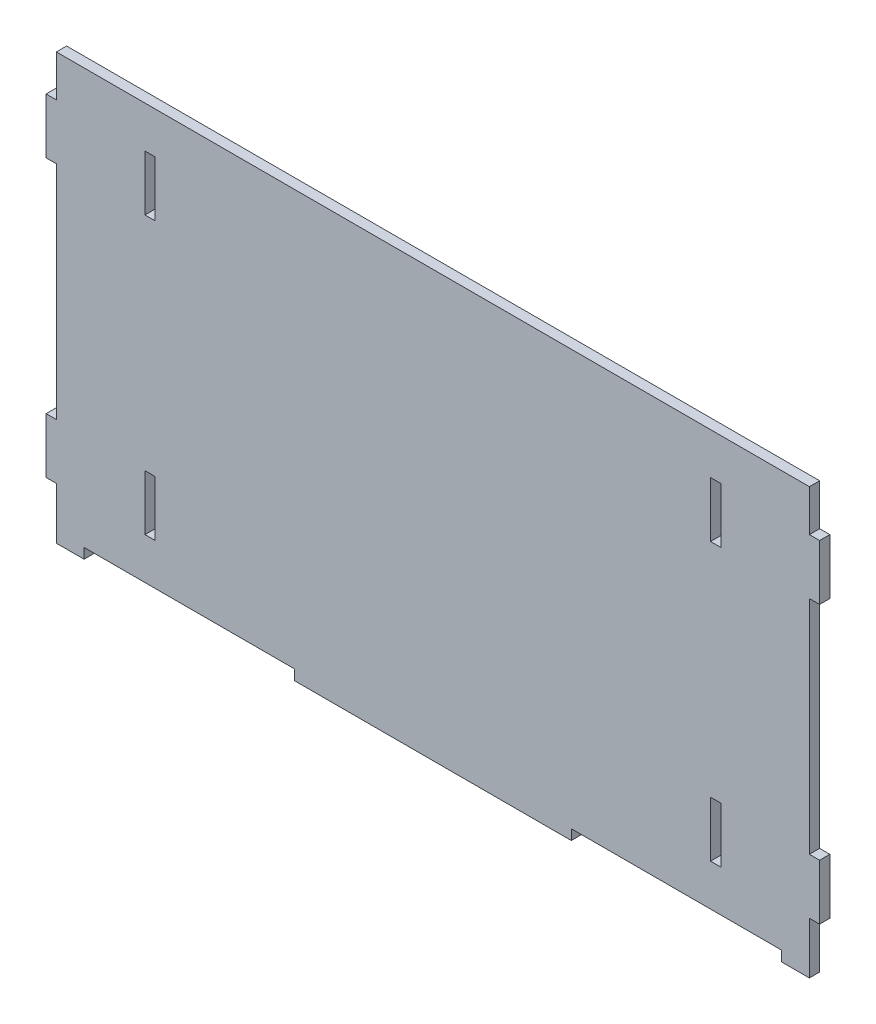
from build123d import *

# Parameters (mm, degrees)
SKETCH1_W      = 3.7
SKETCH1_H      = 20
EXTRUDE1_DEPTH = 3.7


with BuildPart() as part:
    # Sketch1 → Extrude1 (new body)
    with BuildSketch(Plane.XY):
        Polygon((-136, 153.7), (136, 153.7), (136, 138.7), (139.7, 138.7), (139.7, 118.7), (136, 118.7), (136, 38.7), (139.7, 38.7), (139.7, 18.7), (136, 18.7), (136, 0), (126, 0), (126, 3.7), (50, 3.7), (50, 0), (-50, 0), (-50, 3.7), (-126, 3.7), (-126, 0), (-136, 0), (-136, 18.7), (-139.7, 18.7), (-139.7, 38.7), (-136, 38.7), (-136, 118.7), (-139.7, 118.7), (-139.7, 138.7), (-136, 138.7), align=None)
        with Locations((-102.15, 28.7)):
            Rectangle(SKETCH1_W, SKETCH1_H, mode=Mode.SUBTRACT)
        with Locations((-102.15, 128.7)):
            Rectangle(SKETCH1_W, SKETCH1_H, mode=Mode.SUBTRACT)
        with Locations((102.15, 28.7)):
            Rectangle(SKETCH1_W, SKETCH1_H, mode=Mode.SUBTRACT)
        with Locations((102.15, 128.7)):
            Rectangle(SKETCH1_W, SKETCH1_H, mode=Mode.SUBTRACT)
    extrude(amount=EXTRUDE1_DEPTH)


solid = part.part
